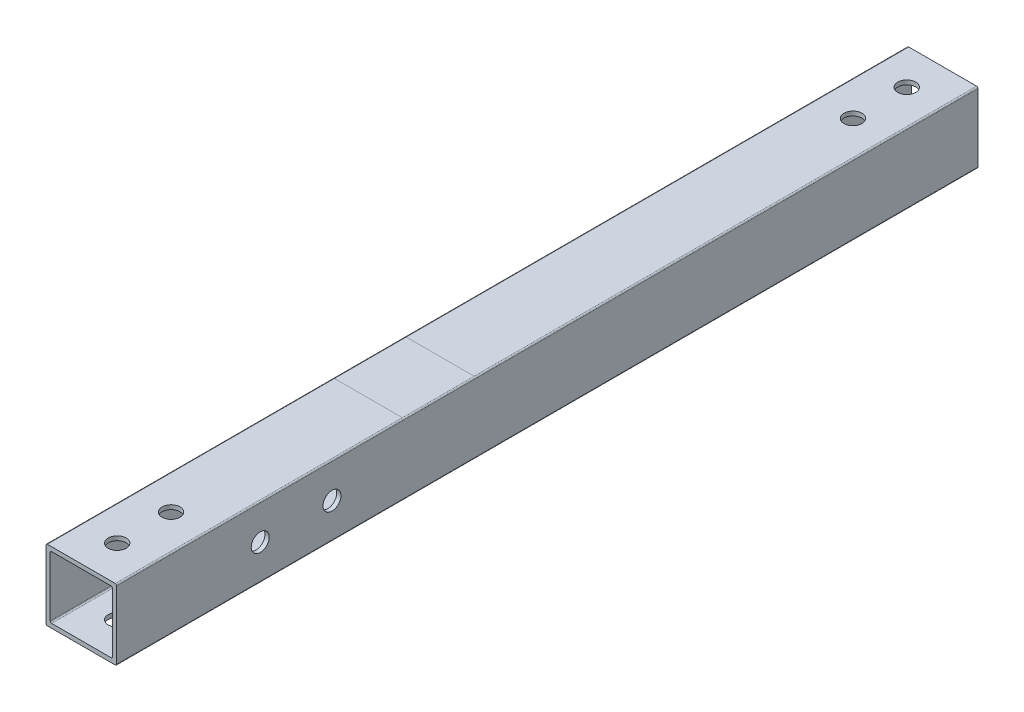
from build123d import *

# Parameters (mm, degrees)
BOSS_EXTRUDE1_DEPTH = 304.8
CUT_EXTRUDE1_REACH  = 2002.195
SKETCH2_R           = 3.175
CUT_EXTRUDE2_REACH  = 2002.195
SKETCH3_R           = 3.175


with BuildPart() as part:
    # Sketch1 → Boss-Extrude1 (new body)
    with BuildSketch(Plane(origin=(0, 0, -2000), x_dir=(-1, 0, 0), z_dir=(0, 0, -1))):
        with BuildLine():
            Line((12.5, -12), (12.5, 12))
            ThreePointArc((12.5, 12), (12.353553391, 12.353553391), (12, 12.5))
            Line((12, 12.5), (-12, 12.5))
            ThreePointArc((-12, 12.5), (-12.353553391, 12.353553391), (-12.5, 12))
            Line((-12.5, 12), (-12.5, -12))
            ThreePointArc((-12.5, -12), (-12.353553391, -12.353553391), (-12, -12.5))
            Line((-12, -12.5), (12, -12.5))
            ThreePointArc((12, -12.5), (12.353553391, -12.353553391), (12.5, -12))
        make_face()
        with BuildLine():
            Line((11, 10.5), (11, -10.5))
            ThreePointArc((11, -10.5), (10.853553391, -10.853553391), (10.5, -11))
            Line((10.5, -11), (-10.5, -11))
            ThreePointArc((-10.5, -11), (-10.853553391, -10.853553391), (-11, -10.5))
            Line((-11, -10.5), (-11, 10.5))
            ThreePointArc((-11, 10.5), (-10.853553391, 10.853553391), (-10.5, 11))
            Line((-10.5, 11), (10.5, 11))
            ThreePointArc((10.5, 11), (10.853553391, 10.853553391), (11, 10.5))
        make_face(mode=Mode.SUBTRACT)
    extrude(amount=-BOSS_EXTRUDE1_DEPTH)

    # Cut-Extrude1: up to this face of the body (flat: up to its plane)
    cut_extrude1_end = Plane(part.part.faces().sort_by_distance((0, -12.5, -1847.6))[0])
    # Sketch2 → Cut-Extrude1 (cut, up to the picked face)
    with BuildSketch(Plane(origin=(0, 12.5, 0), x_dir=(1, 0, 0), z_dir=(0, 1, 0)), mode=Mode.PRIVATE) as cut_extrude1_sk1:
        with Locations(Location((0, 1987.3, 0), (0, 0, 180))):
            Circle(SKETCH2_R)
    cut_extrude1_tool1 = split(extrude(cut_extrude1_sk1.sketch, amount=-CUT_EXTRUDE1_REACH, mode=Mode.PRIVATE), bisect_by=cut_extrude1_end, keep=Keep.BOTH, mode=Mode.PRIVATE)
    # Sketch2 → Cut-Extrude1 (cut, up to the picked face)
    with BuildSketch(Plane(origin=(0, 12.5, 0), x_dir=(1, 0, 0), z_dir=(0, 1, 0)), mode=Mode.PRIVATE) as cut_extrude1_sk2:
        with Locations(Location((0, 1968.25, 0), (0, 0, 180))):
            Circle(SKETCH2_R)
    cut_extrude1_tool2 = split(extrude(cut_extrude1_sk2.sketch, amount=-CUT_EXTRUDE1_REACH, mode=Mode.PRIVATE), bisect_by=cut_extrude1_end, keep=Keep.BOTH, mode=Mode.PRIVATE)
    # Sketch2 → Cut-Extrude1 (cut, up to the picked face)
    with BuildSketch(Plane(origin=(0, 12.5, 0), x_dir=(1, 0, 0), z_dir=(0, 1, 0)), mode=Mode.PRIVATE) as cut_extrude1_sk3:
        with Locations(Location((0, 1707.9, 0), (0, 0, 180))):
            Circle(SKETCH2_R)
    cut_extrude1_tool3 = split(extrude(cut_extrude1_sk3.sketch, amount=-CUT_EXTRUDE1_REACH, mode=Mode.PRIVATE), bisect_by=cut_extrude1_end, keep=Keep.BOTH, mode=Mode.PRIVATE)
    # Sketch2 → Cut-Extrude1 (cut, up to the picked face)
    with BuildSketch(Plane(origin=(0, 12.5, 0), x_dir=(1, 0, 0), z_dir=(0, 1, 0)), mode=Mode.PRIVATE) as cut_extrude1_sk4:
        with Locations(Location((0, 1726.95, 0), (0, 0, 180))):
            Circle(SKETCH2_R)
    cut_extrude1_tool4 = split(extrude(cut_extrude1_sk4.sketch, amount=-CUT_EXTRUDE1_REACH, mode=Mode.PRIVATE), bisect_by=cut_extrude1_end, keep=Keep.BOTH, mode=Mode.PRIVATE)
    add(cut_extrude1_tool1.solids().sort_by(Axis((0, 12.5, -1987.3), (0, -1, 0)))[0], mode=Mode.SUBTRACT)
    add(cut_extrude1_tool2.solids().sort_by(Axis((0, 12.5, -1968.25), (0, -1, 0)))[0], mode=Mode.SUBTRACT)
    add(cut_extrude1_tool3.solids().sort_by(Axis((0, 12.5, -1707.9), (0, -1, 0)))[0], mode=Mode.SUBTRACT)
    add(cut_extrude1_tool4.solids().sort_by(Axis((0, 12.5, -1726.95), (0, -1, 0)))[0], mode=Mode.SUBTRACT)

    # Cut-Extrude2: up to this face of the body (flat: up to its plane)
    cut_extrude2_end = Plane(part.part.faces().sort_by_distance((-12.5, 0, -1847.6))[0])
    # Sketch3 → Cut-Extrude2 (cut, up to the picked face)
    with BuildSketch(Plane(origin=(12.5, 0, 0), x_dir=(0, 0, -1), z_dir=(1, 0, 0)), mode=Mode.PRIVATE) as cut_extrude2_sk1:
        with Locations(Location((1771.4, 0, 0), (0, 0, 90))):
            Circle(SKETCH3_R)
    cut_extrude2_tool1 = split(extrude(cut_extrude2_sk1.sketch, amount=-CUT_EXTRUDE2_REACH, mode=Mode.PRIVATE), bisect_by=cut_extrude2_end, keep=Keep.BOTH, mode=Mode.PRIVATE)
    # Sketch3 → Cut-Extrude2 (cut, up to the picked face)
    with BuildSketch(Plane(origin=(12.5, 0, 0), x_dir=(0, 0, -1), z_dir=(1, 0, 0)), mode=Mode.PRIVATE) as cut_extrude2_sk2:
        with Locations(Location((1746, 0, 0), (0, 0, 90))):
            Circle(SKETCH3_R)
    cut_extrude2_tool2 = split(extrude(cut_extrude2_sk2.sketch, amount=-CUT_EXTRUDE2_REACH, mode=Mode.PRIVATE), bisect_by=cut_extrude2_end, keep=Keep.BOTH, mode=Mode.PRIVATE)
    add(cut_extrude2_tool1.solids().sort_by(Axis((12.5, 0, -1771.4), (-1, 0, 0)))[0], mode=Mode.SUBTRACT)
    add(cut_extrude2_tool2.solids().sort_by(Axis((12.5, 0, -1746), (-1, 0, 0)))[0], mode=Mode.SUBTRACT)


solid = part.part
